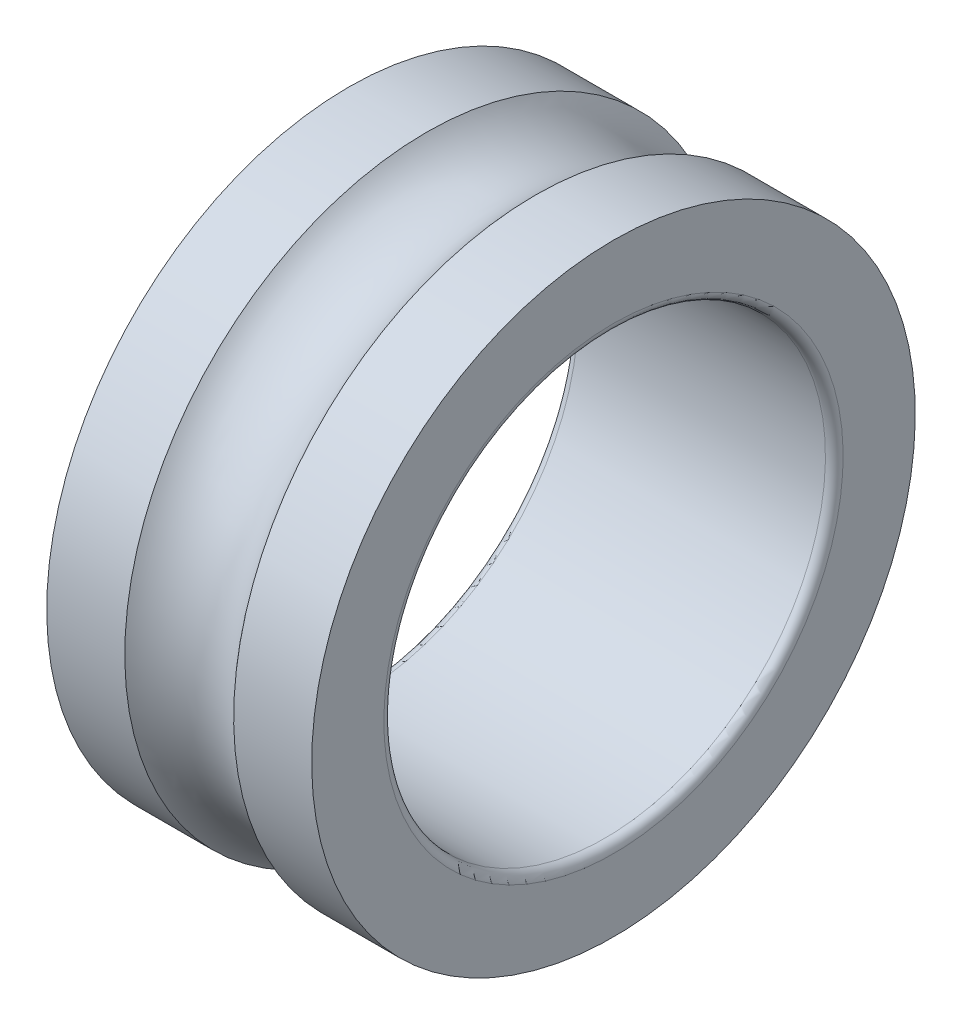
ISO-10303-21;
HEADER;
FILE_DESCRIPTION(('STEP AP214'),'2;1');
FILE_NAME('part.step','',(''),(''),'','','');
FILE_SCHEMA(('AUTOMOTIVE_DESIGN { 1 0 10303 214 1 1 1 1 }'));
ENDSEC;
DATA;
#1=APPLICATION_CONTEXT('core data for automotive mechanical design processes');
#2=APPLICATION_PROTOCOL_DEFINITION('international standard','automotive_design',2000,#1);
#3=PRODUCT_CONTEXT('',#1,'mechanical');
#4=PRODUCT('Part','Part','',(#3));
#5=PRODUCT_RELATED_PRODUCT_CATEGORY('part','',(#4));
#6=PRODUCT_DEFINITION_FORMATION('','',#4);
#7=PRODUCT_DEFINITION_CONTEXT('part definition',#1,'design');
#8=PRODUCT_DEFINITION('design','',#6,#7);
#9=PRODUCT_DEFINITION_SHAPE('','',#8);
#10=(LENGTH_UNIT() NAMED_UNIT(*) SI_UNIT(.MILLI.,.METRE.));
#11=(NAMED_UNIT(*) PLANE_ANGLE_UNIT() SI_UNIT($,.RADIAN.));
#12=(NAMED_UNIT(*) SI_UNIT($,.STERADIAN.) SOLID_ANGLE_UNIT());
#13=UNCERTAINTY_MEASURE_WITH_UNIT(LENGTH_MEASURE(1.E-05),#10,'distance_accuracy_value','');
#14=(GEOMETRIC_REPRESENTATION_CONTEXT(3) GLOBAL_UNCERTAINTY_ASSIGNED_CONTEXT((#13)) GLOBAL_UNIT_ASSIGNED_CONTEXT((#10,
#11,#12)) REPRESENTATION_CONTEXT('',''));
#15=CARTESIAN_POINT('',(0.,0.,0.));
#16=DIRECTION('',(0.,0.,1.));
#17=DIRECTION('',(1.,0.,0.));
#18=AXIS2_PLACEMENT_3D('',#15,#16,#17);
#19=CARTESIAN_POINT('',(7.67454867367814,0.,0.));
#20=DIRECTION('',(-1.,0.,0.));
#21=DIRECTION('',(0.,1.,0.));
#22=AXIS2_PLACEMENT_3D('',#19,#20,#21);
#23=CYLINDRICAL_SURFACE('',#22,10.25);
#24=CARTESIAN_POINT('',(6.34909734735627,0.,0.));
#25=DIRECTION('',(1.,0.,0.));
#26=DIRECTION('',(0.,1.,0.));
#27=AXIS2_PLACEMENT_3D('',#24,#25,#26);
#28=CIRCLE('',#27,10.25);
#29=CARTESIAN_POINT('',(6.34909734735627,10.25,0.));
#30=VERTEX_POINT('',#29);
#31=EDGE_CURVE('E11',#30,#30,#28,.T.);
#32=ORIENTED_EDGE('',*,*,#31,.T.);
#33=EDGE_LOOP('',(#32));
#34=FACE_BOUND('',#33,.T.);
#35=CARTESIAN_POINT('',(9.,0.,0.));
#36=DIRECTION('',(1.,0.,0.));
#37=DIRECTION('',(0.,1.,0.));
#38=AXIS2_PLACEMENT_3D('',#35,#36,#37);
#39=CIRCLE('',#38,10.25);
#40=CARTESIAN_POINT('',(9.,10.25,0.));
#41=VERTEX_POINT('',#40);
#42=EDGE_CURVE('E57',#41,#41,#39,.T.);
#43=ORIENTED_EDGE('',*,*,#42,.F.);
#44=EDGE_LOOP('',(#43));
#45=FACE_BOUND('',#44,.T.);
#46=ADVANCED_FACE('F16',(#34,#45),#23,.T.);
#47=CARTESIAN_POINT('',(4.5,0.,0.));
#48=DIRECTION('',(1.,0.,0.));
#49=DIRECTION('',(0.,0.,-1.));
#50=AXIS2_PLACEMENT_3D('',#47,#48,#49);
#51=TOROIDAL_SURFACE('',#50,11.75,2.381);
#52=CARTESIAN_POINT('',(2.65090265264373,0.,0.));
#53=DIRECTION('',(1.,0.,0.));
#54=DIRECTION('',(0.,1.,0.));
#55=AXIS2_PLACEMENT_3D('',#52,#53,#54);
#56=CIRCLE('',#55,10.25);
#57=CARTESIAN_POINT('',(2.65090265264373,10.25,0.));
#58=VERTEX_POINT('',#57);
#59=EDGE_CURVE('E26',#58,#58,#56,.T.);
#60=ORIENTED_EDGE('',*,*,#59,.T.);
#61=EDGE_LOOP('',(#60));
#62=FACE_BOUND('',#61,.T.);
#63=ORIENTED_EDGE('',*,*,#31,.F.);
#64=EDGE_LOOP('',(#63));
#65=FACE_BOUND('',#64,.T.);
#66=ADVANCED_FACE('F61',(#62,#65),#51,.F.);
#67=CARTESIAN_POINT('',(1.32545132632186,0.,0.));
#68=DIRECTION('',(-1.,0.,0.));
#69=DIRECTION('',(0.,1.,0.));
#70=AXIS2_PLACEMENT_3D('',#67,#68,#69);
#71=CYLINDRICAL_SURFACE('',#70,10.25);
#72=CARTESIAN_POINT('',(0.,0.,0.));
#73=DIRECTION('',(1.,0.,0.));
#74=DIRECTION('',(0.,1.,0.));
#75=AXIS2_PLACEMENT_3D('',#72,#73,#74);
#76=CIRCLE('',#75,10.25);
#77=CARTESIAN_POINT('',(0.,10.25,0.));
#78=VERTEX_POINT('',#77);
#79=EDGE_CURVE('E55',#78,#78,#76,.T.);
#80=ORIENTED_EDGE('',*,*,#79,.T.);
#81=EDGE_LOOP('',(#80));
#82=FACE_BOUND('',#81,.T.);
#83=ORIENTED_EDGE('',*,*,#59,.F.);
#84=EDGE_LOOP('',(#83));
#85=FACE_BOUND('',#84,.T.);
#86=ADVANCED_FACE('F64',(#82,#85),#71,.T.);
#87=CARTESIAN_POINT('',(0.,9.025,0.));
#88=DIRECTION('',(-1.,0.,0.));
#89=DIRECTION('',(0.,-1.,0.));
#90=AXIS2_PLACEMENT_3D('',#87,#88,#89);
#91=PLANE('',#90);
#92=CARTESIAN_POINT('',(0.,0.,0.));
#93=DIRECTION('',(1.,0.,0.));
#94=DIRECTION('',(0.,1.,0.));
#95=AXIS2_PLACEMENT_3D('',#92,#93,#94);
#96=CIRCLE('',#95,7.8);
#97=CARTESIAN_POINT('',(0.,7.8,0.));
#98=VERTEX_POINT('',#97);
#99=EDGE_CURVE('E53',#98,#98,#96,.T.);
#100=ORIENTED_EDGE('',*,*,#99,.T.);
#101=EDGE_LOOP('',(#100));
#102=FACE_BOUND('',#101,.T.);
#103=ORIENTED_EDGE('',*,*,#79,.F.);
#104=EDGE_LOOP('',(#103));
#105=FACE_BOUND('',#104,.T.);
#106=ADVANCED_FACE('F18',(#102,#105),#91,.T.);
#107=CARTESIAN_POINT('',(0.3,0.,0.));
#108=DIRECTION('',(1.,0.,0.));
#109=DIRECTION('',(0.,0.,-1.));
#110=AXIS2_PLACEMENT_3D('',#107,#108,#109);
#111=TOROIDAL_SURFACE('',#110,7.8,0.3);
#112=CARTESIAN_POINT('',(0.3,0.,0.));
#113=DIRECTION('',(1.,0.,0.));
#114=DIRECTION('',(0.,1.,0.));
#115=AXIS2_PLACEMENT_3D('',#112,#113,#114);
#116=CIRCLE('',#115,7.5);
#117=CARTESIAN_POINT('',(0.3,7.5,0.));
#118=VERTEX_POINT('',#117);
#119=EDGE_CURVE('E49',#118,#118,#116,.T.);
#120=ORIENTED_EDGE('',*,*,#119,.T.);
#121=EDGE_LOOP('',(#120));
#122=FACE_BOUND('',#121,.T.);
#123=ORIENTED_EDGE('',*,*,#99,.F.);
#124=EDGE_LOOP('',(#123));
#125=FACE_BOUND('',#124,.T.);
#126=ADVANCED_FACE('F50',(#122,#125),#111,.T.);
#127=CARTESIAN_POINT('',(4.5,0.,0.));
#128=DIRECTION('',(-1.,0.,0.));
#129=DIRECTION('',(0.,1.,0.));
#130=AXIS2_PLACEMENT_3D('',#127,#128,#129);
#131=CYLINDRICAL_SURFACE('',#130,7.5);
#132=CARTESIAN_POINT('',(8.7,0.,0.));
#133=DIRECTION('',(1.,0.,0.));
#134=DIRECTION('',(0.,1.,0.));
#135=AXIS2_PLACEMENT_3D('',#132,#133,#134);
#136=CIRCLE('',#135,7.5);
#137=CARTESIAN_POINT('',(8.7,7.5,0.));
#138=VERTEX_POINT('',#137);
#139=EDGE_CURVE('E20',#138,#138,#136,.T.);
#140=ORIENTED_EDGE('',*,*,#139,.T.);
#141=EDGE_LOOP('',(#140));
#142=FACE_BOUND('',#141,.T.);
#143=ORIENTED_EDGE('',*,*,#119,.F.);
#144=EDGE_LOOP('',(#143));
#145=FACE_BOUND('',#144,.T.);
#146=ADVANCED_FACE('F87',(#142,#145),#131,.F.);
#147=CARTESIAN_POINT('',(8.7,0.,0.));
#148=DIRECTION('',(1.,0.,0.));
#149=DIRECTION('',(0.,0.,-1.));
#150=AXIS2_PLACEMENT_3D('',#147,#148,#149);
#151=TOROIDAL_SURFACE('',#150,7.8,0.3);
#152=CARTESIAN_POINT('',(9.,0.,0.));
#153=DIRECTION('',(1.,0.,0.));
#154=DIRECTION('',(0.,1.,0.));
#155=AXIS2_PLACEMENT_3D('',#152,#153,#154);
#156=CIRCLE('',#155,7.8);
#157=CARTESIAN_POINT('',(9.,7.8,0.));
#158=VERTEX_POINT('',#157);
#159=EDGE_CURVE('E98',#158,#158,#156,.T.);
#160=ORIENTED_EDGE('',*,*,#159,.T.);
#161=EDGE_LOOP('',(#160));
#162=FACE_BOUND('',#161,.T.);
#163=ORIENTED_EDGE('',*,*,#139,.F.);
#164=EDGE_LOOP('',(#163));
#165=FACE_BOUND('',#164,.T.);
#166=ADVANCED_FACE('F84',(#162,#165),#151,.T.);
#167=CARTESIAN_POINT('',(9.,9.025,0.));
#168=DIRECTION('',(1.,0.,0.));
#169=DIRECTION('',(0.,1.,0.));
#170=AXIS2_PLACEMENT_3D('',#167,#168,#169);
#171=PLANE('',#170);
#172=ORIENTED_EDGE('',*,*,#42,.T.);
#173=EDGE_LOOP('',(#172));
#174=FACE_BOUND('',#173,.T.);
#175=ORIENTED_EDGE('',*,*,#159,.F.);
#176=EDGE_LOOP('',(#175));
#177=FACE_BOUND('',#176,.T.);
#178=ADVANCED_FACE('F81',(#174,#177),#171,.T.);
#179=CLOSED_SHELL('',(#46,#66,#86,#106,#126,#146,#166,#178));
#180=MANIFOLD_SOLID_BREP('B1',#179);
#181=ADVANCED_BREP_SHAPE_REPRESENTATION('',(#18,#180),#14);
#182=SHAPE_DEFINITION_REPRESENTATION(#9,#181);
ENDSEC;
END-ISO-10303-21;
